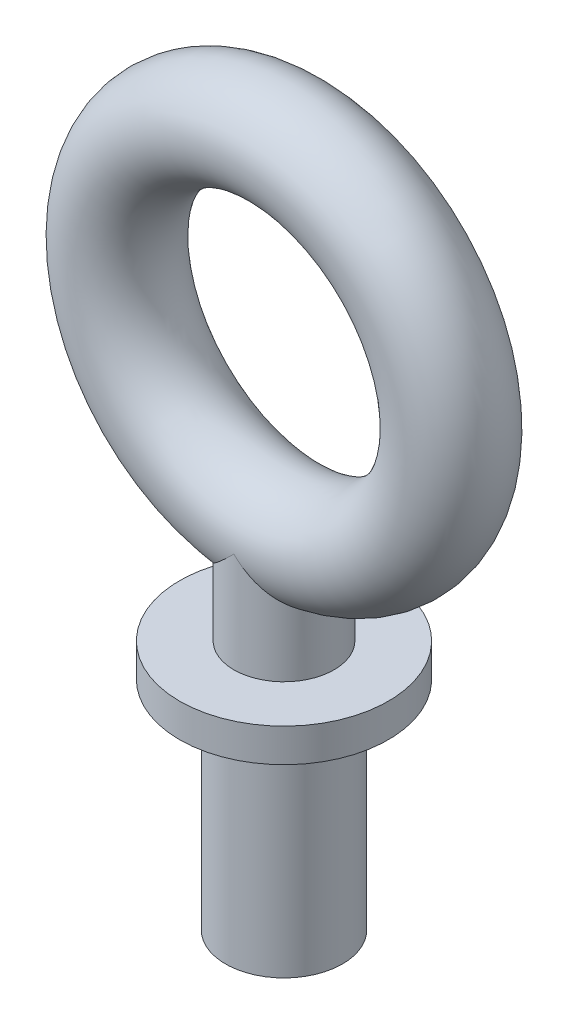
from build123d import *

# Parameters (mm, degrees)
SKETCH1_R                      = 7.62
BOSS_EXTRUDE1_REACH            = 83.081
BOSS_EXTRUDE1_END_MAJOR_RADIUS = 25.4
BOSS_EXTRUDE1_END_MINOR_RADIUS = 7.62
SKETCH2_R                      = 7.62
SKETCH3_R                      = 15.875
BOSS_EXTRUDE2_DEPTH            = 5.08
SKETCH4_R                      = 8.89
BOSS_EXTRUDE3_DEPTH            = 33.02


with BuildPart() as part:
    # Sketch1 → Revolve1 (revolve)
    with BuildSketch(Plane(origin=(0, 0, 0), x_dir=(1, 0, 0), z_dir=(0, 1, 0))):
        with Locations((25.4, 0)):
            Circle(SKETCH1_R)
    revolve(axis=Axis((0, 0, 0), (0, 0, -1)))

    # Boss-Extrude1: up to this torus (the profile starts outside it)
    boss_extrude1_end = Plane(origin=(0, 0, 0), z_dir=(0, 0, 1)) * Torus(BOSS_EXTRUDE1_END_MAJOR_RADIUS, BOSS_EXTRUDE1_END_MINOR_RADIUS, mode=Mode.PRIVATE)
    # Sketch2 → Boss-Extrude1 (add, up to the surface)
    with BuildSketch(Plane(origin=(0, -40.64, 0), x_dir=(1, 0, 0), z_dir=(0, 1, 0)), mode=Mode.PRIVATE) as boss_extrude1_sk1:
        with Locations(Location((0, 0, 0), (0, 0, 270))):
            Circle(SKETCH2_R)
    boss_extrude1_tool1 = extrude(boss_extrude1_sk1.sketch, amount=BOSS_EXTRUDE1_REACH, mode=Mode.PRIVATE) - boss_extrude1_end
    add(boss_extrude1_tool1.solids().sort_by_distance((0, -40.64, 0))[0])

    # Sketch3 → Boss-Extrude2 (add)
    with BuildSketch(Plane.XZ.offset(40.64)):
        with Locations(Location((0, 0, 0), (0, 0, 270))):
            Circle(SKETCH3_R)
    extrude(amount=BOSS_EXTRUDE2_DEPTH)

    # Sketch4 → Boss-Extrude3 (add)
    with BuildSketch(Plane.XZ.offset(45.72)):
        with Locations(Location((0, 0, 0), (0, 0, 270))):
            Circle(SKETCH4_R)
    extrude(amount=BOSS_EXTRUDE3_DEPTH)


solid = part.part
